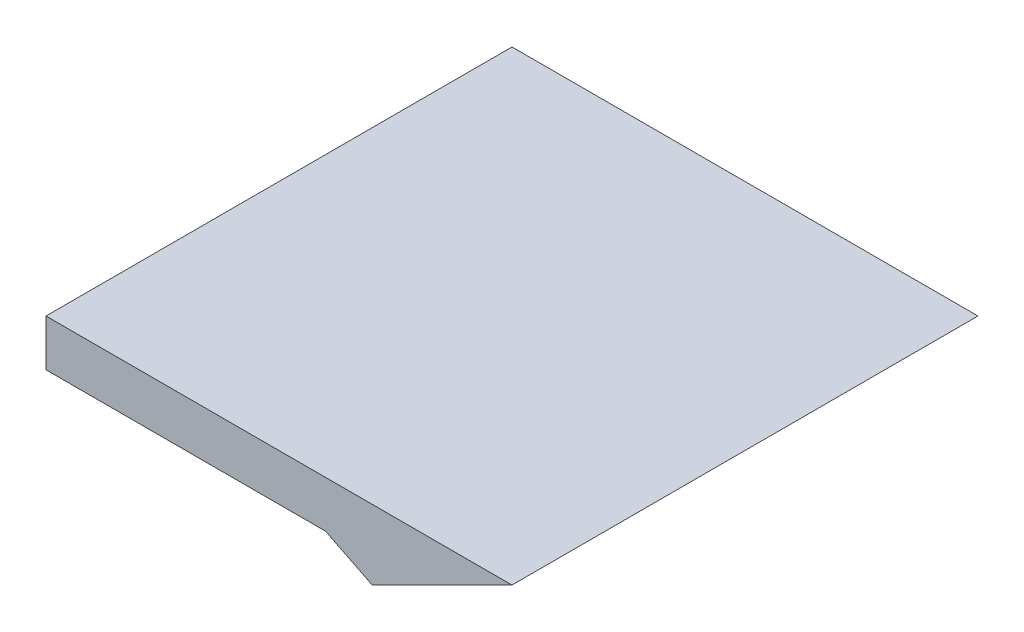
ISO-10303-21;
HEADER;
FILE_DESCRIPTION(('STEP AP214'),'2;1');
FILE_NAME('part.step','',(''),(''),'','','');
FILE_SCHEMA(('AUTOMOTIVE_DESIGN { 1 0 10303 214 1 1 1 1 }'));
ENDSEC;
DATA;
#1=APPLICATION_CONTEXT('core data for automotive mechanical design processes');
#2=APPLICATION_PROTOCOL_DEFINITION('international standard','automotive_design',2000,#1);
#3=PRODUCT_CONTEXT('',#1,'mechanical');
#4=PRODUCT('Part','Part','',(#3));
#5=PRODUCT_RELATED_PRODUCT_CATEGORY('part','',(#4));
#6=PRODUCT_DEFINITION_FORMATION('','',#4);
#7=PRODUCT_DEFINITION_CONTEXT('part definition',#1,'design');
#8=PRODUCT_DEFINITION('design','',#6,#7);
#9=PRODUCT_DEFINITION_SHAPE('','',#8);
#10=(LENGTH_UNIT() NAMED_UNIT(*) SI_UNIT(.MILLI.,.METRE.));
#11=(NAMED_UNIT(*) PLANE_ANGLE_UNIT() SI_UNIT($,.RADIAN.));
#12=(NAMED_UNIT(*) SI_UNIT($,.STERADIAN.) SOLID_ANGLE_UNIT());
#13=UNCERTAINTY_MEASURE_WITH_UNIT(LENGTH_MEASURE(1.E-05),#10,'distance_accuracy_value','');
#14=(GEOMETRIC_REPRESENTATION_CONTEXT(3) GLOBAL_UNCERTAINTY_ASSIGNED_CONTEXT((#13)) GLOBAL_UNIT_ASSIGNED_CONTEXT((#10,
#11,#12)) REPRESENTATION_CONTEXT('',''));
#15=CARTESIAN_POINT('',(0.,0.,0.));
#16=DIRECTION('',(0.,0.,1.));
#17=DIRECTION('',(1.,0.,0.));
#18=AXIS2_PLACEMENT_3D('',#15,#16,#17);
#19=CARTESIAN_POINT('',(-23.3771297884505,0.,10.));
#20=DIRECTION('',(1.,0.,0.));
#21=DIRECTION('',(0.,0.,-1.));
#22=AXIS2_PLACEMENT_3D('',#19,#20,#21);
#23=PLANE('',#22);
#24=DIRECTION('',(0.,-1.,0.));
#25=VECTOR('',#24,1.);
#26=CARTESIAN_POINT('',(-23.3771297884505,0.,0.));
#27=LINE('',#26,#25);
#28=CARTESIAN_POINT('',(-23.3771297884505,1.,0.));
#29=VERTEX_POINT('',#28);
#30=CARTESIAN_POINT('',(-23.3771297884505,0.,0.));
#31=VERTEX_POINT('',#30);
#32=EDGE_CURVE('E109',#29,#31,#27,.T.);
#33=ORIENTED_EDGE('',*,*,#32,.T.);
#34=DIRECTION('',(0.,0.,-1.));
#35=VECTOR('',#34,1.);
#36=CARTESIAN_POINT('',(-23.3771297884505,0.,10.));
#37=LINE('',#36,#35);
#38=CARTESIAN_POINT('',(-23.3771297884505,0.,10.));
#39=VERTEX_POINT('',#38);
#40=EDGE_CURVE('E11',#39,#31,#37,.T.);
#41=ORIENTED_EDGE('',*,*,#40,.F.);
#42=DIRECTION('',(0.,-1.,0.));
#43=VECTOR('',#42,1.);
#44=CARTESIAN_POINT('',(-23.3771297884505,0.,10.));
#45=LINE('',#44,#43);
#46=CARTESIAN_POINT('',(-23.3771297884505,1.,10.));
#47=VERTEX_POINT('',#46);
#48=EDGE_CURVE('E117',#47,#39,#45,.T.);
#49=ORIENTED_EDGE('',*,*,#48,.F.);
#50=DIRECTION('',(0.,0.,-1.));
#51=VECTOR('',#50,1.);
#52=CARTESIAN_POINT('',(-23.3771297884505,1.,10.));
#53=LINE('',#52,#51);
#54=EDGE_CURVE('E105',#47,#29,#53,.T.);
#55=ORIENTED_EDGE('',*,*,#54,.T.);
#56=EDGE_LOOP('',(#33,#41,#49,#55));
#57=FACE_BOUND('',#56,.T.);
#58=ADVANCED_FACE('F35',(#57),#23,.F.);
#59=CARTESIAN_POINT('',(-23.3771297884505,0.,10.));
#60=DIRECTION('',(0.,1.,0.));
#61=DIRECTION('',(-1.,0.,0.));
#62=AXIS2_PLACEMENT_3D('',#59,#60,#61);
#63=PLANE('',#62);
#64=DIRECTION('',(1.,0.,0.));
#65=VECTOR('',#64,1.);
#66=CARTESIAN_POINT('',(-23.3771297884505,0.,0.));
#67=LINE('',#66,#65);
#68=CARTESIAN_POINT('',(-17.3771297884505,0.,0.));
#69=VERTEX_POINT('',#68);
#70=EDGE_CURVE('E112',#31,#69,#67,.T.);
#71=ORIENTED_EDGE('',*,*,#70,.T.);
#72=DIRECTION('',(0.,0.,-1.));
#73=VECTOR('',#72,1.);
#74=CARTESIAN_POINT('',(-17.3771297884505,0.,10.));
#75=LINE('',#74,#73);
#76=CARTESIAN_POINT('',(-17.3771297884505,0.,10.));
#77=VERTEX_POINT('',#76);
#78=EDGE_CURVE('E43',#77,#69,#75,.T.);
#79=ORIENTED_EDGE('',*,*,#78,.F.);
#80=DIRECTION('',(1.,0.,0.));
#81=VECTOR('',#80,1.);
#82=CARTESIAN_POINT('',(-23.3771297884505,0.,10.));
#83=LINE('',#82,#81);
#84=EDGE_CURVE('E85',#39,#77,#83,.T.);
#85=ORIENTED_EDGE('',*,*,#84,.F.);
#86=ORIENTED_EDGE('',*,*,#40,.T.);
#87=EDGE_LOOP('',(#71,#79,#85,#86));
#88=FACE_BOUND('',#87,.T.);
#89=ADVANCED_FACE('F136',(#88),#63,.F.);
#90=CARTESIAN_POINT('',(-16.3771297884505,-0.5,10.));
#91=DIRECTION('',(0.447213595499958,0.894427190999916,0.));
#92=DIRECTION('',(-0.894427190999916,0.447213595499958,0.));
#93=AXIS2_PLACEMENT_3D('',#90,#91,#92);
#94=PLANE('',#93);
#95=DIRECTION('',(0.894427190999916,-0.447213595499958,0.));
#96=VECTOR('',#95,1.);
#97=CARTESIAN_POINT('',(-16.3771297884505,-0.5,0.));
#98=LINE('',#97,#96);
#99=CARTESIAN_POINT('',(-16.3771297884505,-0.5,0.));
#100=VERTEX_POINT('',#99);
#101=EDGE_CURVE('E100',#69,#100,#98,.T.);
#102=ORIENTED_EDGE('',*,*,#101,.T.);
#103=DIRECTION('',(0.,0.,-1.));
#104=VECTOR('',#103,1.);
#105=CARTESIAN_POINT('',(-16.3771297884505,-0.5,10.));
#106=LINE('',#105,#104);
#107=CARTESIAN_POINT('',(-16.3771297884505,-0.5,10.));
#108=VERTEX_POINT('',#107);
#109=EDGE_CURVE('E97',#108,#100,#106,.T.);
#110=ORIENTED_EDGE('',*,*,#109,.F.);
#111=DIRECTION('',(0.894427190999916,-0.447213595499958,0.));
#112=VECTOR('',#111,1.);
#113=CARTESIAN_POINT('',(-16.3771297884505,-0.5,10.));
#114=LINE('',#113,#112);
#115=EDGE_CURVE('E89',#77,#108,#114,.T.);
#116=ORIENTED_EDGE('',*,*,#115,.F.);
#117=ORIENTED_EDGE('',*,*,#78,.T.);
#118=EDGE_LOOP('',(#102,#110,#116,#117));
#119=FACE_BOUND('',#118,.T.);
#120=ADVANCED_FACE('F98',(#119),#94,.F.);
#121=CARTESIAN_POINT('',(-16.3771297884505,-0.5,10.));
#122=DIRECTION('',(-0.447213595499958,0.894427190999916,0.));
#123=DIRECTION('',(-0.894427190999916,-0.447213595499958,0.));
#124=AXIS2_PLACEMENT_3D('',#121,#122,#123);
#125=PLANE('',#124);
#126=DIRECTION('',(0.894427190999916,0.447213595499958,0.));
#127=VECTOR('',#126,1.);
#128=CARTESIAN_POINT('',(-16.3771297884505,-0.5,0.));
#129=LINE('',#128,#127);
#130=CARTESIAN_POINT('',(-13.3771297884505,1.,0.));
#131=VERTEX_POINT('',#130);
#132=EDGE_CURVE('E71',#100,#131,#129,.T.);
#133=ORIENTED_EDGE('',*,*,#132,.T.);
#134=DIRECTION('',(0.,0.,-1.));
#135=VECTOR('',#134,1.);
#136=CARTESIAN_POINT('',(-13.3771297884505,1.,10.));
#137=LINE('',#136,#135);
#138=CARTESIAN_POINT('',(-13.3771297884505,1.,10.));
#139=VERTEX_POINT('',#138);
#140=EDGE_CURVE('E101',#139,#131,#137,.T.);
#141=ORIENTED_EDGE('',*,*,#140,.F.);
#142=DIRECTION('',(0.894427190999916,0.447213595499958,0.));
#143=VECTOR('',#142,1.);
#144=CARTESIAN_POINT('',(-16.3771297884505,-0.5,10.));
#145=LINE('',#144,#143);
#146=EDGE_CURVE('E93',#108,#139,#145,.T.);
#147=ORIENTED_EDGE('',*,*,#146,.F.);
#148=ORIENTED_EDGE('',*,*,#109,.T.);
#149=EDGE_LOOP('',(#133,#141,#147,#148));
#150=FACE_BOUND('',#149,.T.);
#151=ADVANCED_FACE('F103',(#150),#125,.F.);
#152=CARTESIAN_POINT('',(-23.3771297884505,1.,10.));
#153=DIRECTION('',(0.,-1.,0.));
#154=DIRECTION('',(0.,0.,-1.));
#155=AXIS2_PLACEMENT_3D('',#152,#153,#154);
#156=PLANE('',#155);
#157=DIRECTION('',(-1.,0.,0.));
#158=VECTOR('',#157,1.);
#159=CARTESIAN_POINT('',(-23.3771297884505,1.,0.));
#160=LINE('',#159,#158);
#161=EDGE_CURVE('E77',#131,#29,#160,.T.);
#162=ORIENTED_EDGE('',*,*,#161,.T.);
#163=ORIENTED_EDGE('',*,*,#54,.F.);
#164=DIRECTION('',(-1.,0.,0.));
#165=VECTOR('',#164,1.);
#166=CARTESIAN_POINT('',(-23.3771297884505,1.,10.));
#167=LINE('',#166,#165);
#168=EDGE_CURVE('E51',#139,#47,#167,.T.);
#169=ORIENTED_EDGE('',*,*,#168,.F.);
#170=ORIENTED_EDGE('',*,*,#140,.T.);
#171=EDGE_LOOP('',(#162,#163,#169,#170));
#172=FACE_BOUND('',#171,.T.);
#173=ADVANCED_FACE('F125',(#172),#156,.F.);
#174=CARTESIAN_POINT('',(0.,0.,10.));
#175=DIRECTION('',(0.,0.,-1.));
#176=DIRECTION('',(-1.,0.,0.));
#177=AXIS2_PLACEMENT_3D('',#174,#175,#176);
#178=PLANE('',#177);
#179=ORIENTED_EDGE('',*,*,#48,.T.);
#180=ORIENTED_EDGE('',*,*,#84,.T.);
#181=ORIENTED_EDGE('',*,*,#115,.T.);
#182=ORIENTED_EDGE('',*,*,#146,.T.);
#183=ORIENTED_EDGE('',*,*,#168,.T.);
#184=EDGE_LOOP('',(#179,#180,#181,#182,#183));
#185=FACE_BOUND('',#184,.T.);
#186=ADVANCED_FACE('F91',(#185),#178,.F.);
#187=CARTESIAN_POINT('',(0.,0.,0.));
#188=DIRECTION('',(0.,0.,-1.));
#189=DIRECTION('',(-1.,0.,0.));
#190=AXIS2_PLACEMENT_3D('',#187,#188,#189);
#191=PLANE('',#190);
#192=ORIENTED_EDGE('',*,*,#32,.F.);
#193=ORIENTED_EDGE('',*,*,#161,.F.);
#194=ORIENTED_EDGE('',*,*,#132,.F.);
#195=ORIENTED_EDGE('',*,*,#101,.F.);
#196=ORIENTED_EDGE('',*,*,#70,.F.);
#197=EDGE_LOOP('',(#192,#193,#194,#195,#196));
#198=FACE_BOUND('',#197,.T.);
#199=ADVANCED_FACE('F121',(#198),#191,.T.);
#200=CLOSED_SHELL('',(#58,#89,#120,#151,#173,#186,#199));
#201=MANIFOLD_SOLID_BREP('B2',#200);
#202=ADVANCED_BREP_SHAPE_REPRESENTATION('',(#18,#201),#14);
#203=SHAPE_DEFINITION_REPRESENTATION(#9,#202);
ENDSEC;
END-ISO-10303-21;
